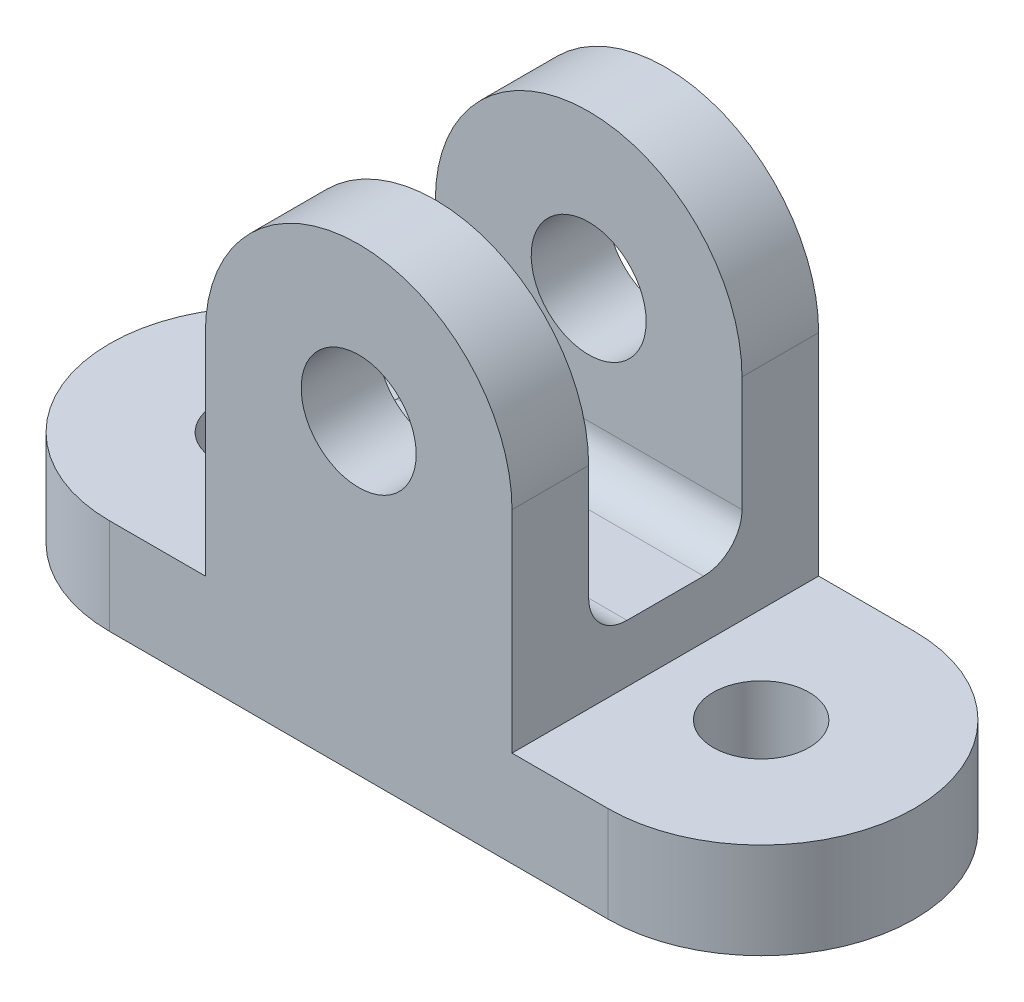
ISO-10303-21;
HEADER;
FILE_DESCRIPTION(('STEP AP214'),'2;1');
FILE_NAME('part.step','',(''),(''),'','','');
FILE_SCHEMA(('AUTOMOTIVE_DESIGN { 1 0 10303 214 1 1 1 1 }'));
ENDSEC;
DATA;
#1=APPLICATION_CONTEXT('core data for automotive mechanical design processes');
#2=APPLICATION_PROTOCOL_DEFINITION('international standard','automotive_design',2000,#1);
#3=PRODUCT_CONTEXT('',#1,'mechanical');
#4=PRODUCT('Part','Part','',(#3));
#5=PRODUCT_RELATED_PRODUCT_CATEGORY('part','',(#4));
#6=PRODUCT_DEFINITION_FORMATION('','',#4);
#7=PRODUCT_DEFINITION_CONTEXT('part definition',#1,'design');
#8=PRODUCT_DEFINITION('design','',#6,#7);
#9=PRODUCT_DEFINITION_SHAPE('','',#8);
#10=(LENGTH_UNIT() NAMED_UNIT(*) SI_UNIT(.MILLI.,.METRE.));
#11=(NAMED_UNIT(*) PLANE_ANGLE_UNIT() SI_UNIT($,.RADIAN.));
#12=(NAMED_UNIT(*) SI_UNIT($,.STERADIAN.) SOLID_ANGLE_UNIT());
#13=UNCERTAINTY_MEASURE_WITH_UNIT(LENGTH_MEASURE(1.E-05),#10,'distance_accuracy_value','');
#14=(GEOMETRIC_REPRESENTATION_CONTEXT(3) GLOBAL_UNCERTAINTY_ASSIGNED_CONTEXT((#13)) GLOBAL_UNIT_ASSIGNED_CONTEXT((#10,
#11,#12)) REPRESENTATION_CONTEXT('',''));
#15=CARTESIAN_POINT('',(0.,0.,0.));
#16=DIRECTION('',(0.,0.,1.));
#17=DIRECTION('',(1.,0.,0.));
#18=AXIS2_PLACEMENT_3D('',#15,#16,#17);
#19=CARTESIAN_POINT('',(0.,16.,-32.8394846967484));
#20=DIRECTION('',(0.,0.,1.));
#21=DIRECTION('',(1.,0.,0.));
#22=AXIS2_PLACEMENT_3D('',#19,#20,#21);
#23=CYLINDRICAL_SURFACE('',#22,8.);
#24=CARTESIAN_POINT('',(0.,16.,4.));
#25=DIRECTION('',(0.,0.,1.));
#26=DIRECTION('',(0.,-1.,0.));
#27=AXIS2_PLACEMENT_3D('',#24,#25,#26);
#28=CIRCLE('',#27,8.);
#29=CARTESIAN_POINT('',(-8.,16.,4.));
#30=VERTEX_POINT('',#29);
#31=CARTESIAN_POINT('',(8.,16.,4.));
#32=VERTEX_POINT('',#31);
#33=EDGE_CURVE('E313',#30,#32,#28,.F.);
#34=ORIENTED_EDGE('',*,*,#33,.F.);
#35=DIRECTION('',(0.,0.,1.));
#36=VECTOR('',#35,1.);
#37=CARTESIAN_POINT('',(-8.,16.,-32.8394846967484));
#38=LINE('',#37,#36);
#39=CARTESIAN_POINT('',(-8.,16.,8.));
#40=VERTEX_POINT('',#39);
#41=EDGE_CURVE('E161',#30,#40,#38,.T.);
#42=ORIENTED_EDGE('',*,*,#41,.T.);
#43=CARTESIAN_POINT('',(0.,16.,8.));
#44=DIRECTION('',(0.,0.,1.));
#45=DIRECTION('',(-1.,0.,0.));
#46=AXIS2_PLACEMENT_3D('',#43,#44,#45);
#47=CIRCLE('',#46,8.);
#48=CARTESIAN_POINT('',(8.,16.,8.));
#49=VERTEX_POINT('',#48);
#50=EDGE_CURVE('E324',#49,#40,#47,.T.);
#51=ORIENTED_EDGE('',*,*,#50,.F.);
#52=DIRECTION('',(0.,0.,1.));
#53=VECTOR('',#52,1.);
#54=CARTESIAN_POINT('',(8.,16.,-32.8394846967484));
#55=LINE('',#54,#53);
#56=EDGE_CURVE('E162',#32,#49,#55,.T.);
#57=ORIENTED_EDGE('',*,*,#56,.F.);
#58=EDGE_LOOP('',(#34,#42,#51,#57));
#59=FACE_BOUND('',#58,.T.);
#60=ADVANCED_FACE('F35',(#59),#23,.T.);
#61=CARTESIAN_POINT('',(-13.,5.,0.));
#62=DIRECTION('',(0.,1.,0.));
#63=DIRECTION('',(0.,0.,1.));
#64=AXIS2_PLACEMENT_3D('',#61,#62,#63);
#65=PLANE('',#64);
#66=CARTESIAN_POINT('',(13.,5.,0.));
#67=DIRECTION('',(0.,1.,0.));
#68=DIRECTION('',(0.,0.,1.));
#69=AXIS2_PLACEMENT_3D('',#66,#67,#68);
#70=CIRCLE('',#69,2.5);
#71=CARTESIAN_POINT('',(13.,5.,2.5));
#72=VERTEX_POINT('',#71);
#73=EDGE_CURVE('E296',#72,#72,#70,.T.);
#74=ORIENTED_EDGE('',*,*,#73,.F.);
#75=EDGE_LOOP('',(#74));
#76=FACE_BOUND('',#75,.T.);
#77=DIRECTION('',(-1.,0.,0.));
#78=VECTOR('',#77,1.);
#79=CARTESIAN_POINT('',(-13.,5.,-8.));
#80=LINE('',#79,#78);
#81=CARTESIAN_POINT('',(13.,5.,-8.00000000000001));
#82=VERTEX_POINT('',#81);
#83=CARTESIAN_POINT('',(8.,5.,-8.));
#84=VERTEX_POINT('',#83);
#85=EDGE_CURVE('E183',#82,#84,#80,.T.);
#86=ORIENTED_EDGE('',*,*,#85,.T.);
#87=DIRECTION('',(0.,0.,1.));
#88=VECTOR('',#87,1.);
#89=CARTESIAN_POINT('',(8.,5.,-32.8394846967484));
#90=LINE('',#89,#88);
#91=CARTESIAN_POINT('',(8.,5.,8.));
#92=VERTEX_POINT('',#91);
#93=EDGE_CURVE('E165',#84,#92,#90,.T.);
#94=ORIENTED_EDGE('',*,*,#93,.T.);
#95=DIRECTION('',(1.,0.,0.));
#96=VECTOR('',#95,1.);
#97=CARTESIAN_POINT('',(-13.,5.,8.));
#98=LINE('',#97,#96);
#99=CARTESIAN_POINT('',(13.,5.,7.99999999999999));
#100=VERTEX_POINT('',#99);
#101=EDGE_CURVE('E176',#92,#100,#98,.T.);
#102=ORIENTED_EDGE('',*,*,#101,.T.);
#103=CARTESIAN_POINT('',(13.,5.,0.));
#104=DIRECTION('',(0.,1.,0.));
#105=DIRECTION('',(0.,0.,1.));
#106=AXIS2_PLACEMENT_3D('',#103,#104,#105);
#107=CIRCLE('',#106,8.);
#108=EDGE_CURVE('E180',#100,#82,#107,.T.);
#109=ORIENTED_EDGE('',*,*,#108,.T.);
#110=EDGE_LOOP('',(#86,#94,#102,#109));
#111=FACE_BOUND('',#110,.T.);
#112=ADVANCED_FACE('F239',(#76,#111),#65,.T.);
#113=CARTESIAN_POINT('',(-13.,5.,0.));
#114=DIRECTION('',(0.,-1.,0.));
#115=DIRECTION('',(0.,0.,-1.));
#116=AXIS2_PLACEMENT_3D('',#113,#114,#115);
#117=CYLINDRICAL_SURFACE('',#116,8.);
#118=CARTESIAN_POINT('',(-13.,0.,0.));
#119=DIRECTION('',(0.,1.,0.));
#120=DIRECTION('',(0.,0.,1.));
#121=AXIS2_PLACEMENT_3D('',#118,#119,#120);
#122=CIRCLE('',#121,8.);
#123=CARTESIAN_POINT('',(-13.,0.,-8.));
#124=VERTEX_POINT('',#123);
#125=CARTESIAN_POINT('',(-13.,0.,8.));
#126=VERTEX_POINT('',#125);
#127=EDGE_CURVE('E171',#124,#126,#122,.T.);
#128=ORIENTED_EDGE('',*,*,#127,.T.);
#129=DIRECTION('',(0.,-1.,0.));
#130=VECTOR('',#129,1.);
#131=CARTESIAN_POINT('',(-13.,5.,8.));
#132=LINE('',#131,#130);
#133=CARTESIAN_POINT('',(-13.,5.,8.));
#134=VERTEX_POINT('',#133);
#135=EDGE_CURVE('E201',#134,#126,#132,.T.);
#136=ORIENTED_EDGE('',*,*,#135,.F.);
#137=CARTESIAN_POINT('',(-13.,5.,0.));
#138=DIRECTION('',(0.,1.,0.));
#139=DIRECTION('',(0.,0.,1.));
#140=AXIS2_PLACEMENT_3D('',#137,#138,#139);
#141=CIRCLE('',#140,8.);
#142=CARTESIAN_POINT('',(-13.,5.,-8.));
#143=VERTEX_POINT('',#142);
#144=EDGE_CURVE('E173',#143,#134,#141,.T.);
#145=ORIENTED_EDGE('',*,*,#144,.F.);
#146=DIRECTION('',(0.,-1.,0.));
#147=VECTOR('',#146,1.);
#148=CARTESIAN_POINT('',(-13.,5.,-8.));
#149=LINE('',#148,#147);
#150=EDGE_CURVE('E185',#143,#124,#149,.T.);
#151=ORIENTED_EDGE('',*,*,#150,.T.);
#152=EDGE_LOOP('',(#128,#136,#145,#151));
#153=FACE_BOUND('',#152,.T.);
#154=ADVANCED_FACE('F245',(#153),#117,.T.);
#155=CARTESIAN_POINT('',(-13.,5.,8.));
#156=DIRECTION('',(0.,0.,-1.));
#157=DIRECTION('',(-1.,0.,0.));
#158=AXIS2_PLACEMENT_3D('',#155,#156,#157);
#159=PLANE('',#158);
#160=CARTESIAN_POINT('',(0.,16.,8.));
#161=DIRECTION('',(0.,0.,1.));
#162=DIRECTION('',(1.,0.,0.));
#163=AXIS2_PLACEMENT_3D('',#160,#161,#162);
#164=CIRCLE('',#163,3.);
#165=CARTESIAN_POINT('',(3.,16.,8.));
#166=VERTEX_POINT('',#165);
#167=EDGE_CURVE('E293',#166,#166,#164,.T.);
#168=ORIENTED_EDGE('',*,*,#167,.F.);
#169=EDGE_LOOP('',(#168));
#170=FACE_BOUND('',#169,.T.);
#171=DIRECTION('',(1.,0.,0.));
#172=VECTOR('',#171,1.);
#173=CARTESIAN_POINT('',(-13.,0.,8.));
#174=LINE('',#173,#172);
#175=CARTESIAN_POINT('',(13.,0.,7.99999999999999));
#176=VERTEX_POINT('',#175);
#177=EDGE_CURVE('E188',#126,#176,#174,.T.);
#178=ORIENTED_EDGE('',*,*,#177,.T.);
#179=DIRECTION('',(0.,-1.,0.));
#180=VECTOR('',#179,1.);
#181=CARTESIAN_POINT('',(13.,5.,7.99999999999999));
#182=LINE('',#181,#180);
#183=EDGE_CURVE('E198',#100,#176,#182,.T.);
#184=ORIENTED_EDGE('',*,*,#183,.F.);
#185=ORIENTED_EDGE('',*,*,#101,.F.);
#186=DIRECTION('',(0.,1.,0.));
#187=VECTOR('',#186,1.);
#188=CARTESIAN_POINT('',(8.,16.,8.));
#189=LINE('',#188,#187);
#190=EDGE_CURVE('E317',#92,#49,#189,.T.);
#191=ORIENTED_EDGE('',*,*,#190,.T.);
#192=ORIENTED_EDGE('',*,*,#50,.T.);
#193=DIRECTION('',(0.,-1.,0.));
#194=VECTOR('',#193,1.);
#195=CARTESIAN_POINT('',(-8.,5.,8.));
#196=LINE('',#195,#194);
#197=CARTESIAN_POINT('',(-8.,5.,8.));
#198=VERTEX_POINT('',#197);
#199=EDGE_CURVE('E169',#40,#198,#196,.T.);
#200=ORIENTED_EDGE('',*,*,#199,.T.);
#201=EDGE_CURVE('E178',#134,#198,#98,.T.);
#202=ORIENTED_EDGE('',*,*,#201,.F.);
#203=ORIENTED_EDGE('',*,*,#135,.T.);
#204=EDGE_LOOP('',(#178,#184,#185,#191,#192,#200,#202,#203));
#205=FACE_BOUND('',#204,.T.);
#206=ADVANCED_FACE('F335',(#170,#205),#159,.F.);
#207=CARTESIAN_POINT('',(13.,5.,0.));
#208=DIRECTION('',(0.,-1.,0.));
#209=DIRECTION('',(0.,0.,-1.));
#210=AXIS2_PLACEMENT_3D('',#207,#208,#209);
#211=CYLINDRICAL_SURFACE('',#210,8.);
#212=CARTESIAN_POINT('',(13.,0.,0.));
#213=DIRECTION('',(0.,1.,0.));
#214=DIRECTION('',(0.,0.,1.));
#215=AXIS2_PLACEMENT_3D('',#212,#213,#214);
#216=CIRCLE('',#215,8.);
#217=CARTESIAN_POINT('',(13.,0.,-8.00000000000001));
#218=VERTEX_POINT('',#217);
#219=EDGE_CURVE('E190',#176,#218,#216,.T.);
#220=ORIENTED_EDGE('',*,*,#219,.T.);
#221=DIRECTION('',(0.,-1.,0.));
#222=VECTOR('',#221,1.);
#223=CARTESIAN_POINT('',(13.,5.,-8.00000000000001));
#224=LINE('',#223,#222);
#225=EDGE_CURVE('E195',#82,#218,#224,.T.);
#226=ORIENTED_EDGE('',*,*,#225,.F.);
#227=ORIENTED_EDGE('',*,*,#108,.F.);
#228=ORIENTED_EDGE('',*,*,#183,.T.);
#229=EDGE_LOOP('',(#220,#226,#227,#228));
#230=FACE_BOUND('',#229,.T.);
#231=ADVANCED_FACE('F350',(#230),#211,.T.);
#232=CARTESIAN_POINT('',(-13.,5.,-8.));
#233=DIRECTION('',(0.,0.,1.));
#234=DIRECTION('',(1.,0.,0.));
#235=AXIS2_PLACEMENT_3D('',#232,#233,#234);
#236=PLANE('',#235);
#237=CARTESIAN_POINT('',(0.,16.,-8.00000000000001));
#238=DIRECTION('',(0.,0.,1.));
#239=DIRECTION('',(1.,0.,0.));
#240=AXIS2_PLACEMENT_3D('',#237,#238,#239);
#241=CIRCLE('',#240,3.);
#242=CARTESIAN_POINT('',(3.,16.,-8.00000000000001));
#243=VERTEX_POINT('',#242);
#244=EDGE_CURVE('E212',#243,#243,#241,.T.);
#245=ORIENTED_EDGE('',*,*,#244,.T.);
#246=EDGE_LOOP('',(#245));
#247=FACE_BOUND('',#246,.T.);
#248=DIRECTION('',(-1.,0.,0.));
#249=VECTOR('',#248,1.);
#250=CARTESIAN_POINT('',(-13.,0.,-8.));
#251=LINE('',#250,#249);
#252=EDGE_CURVE('E177',#218,#124,#251,.T.);
#253=ORIENTED_EDGE('',*,*,#252,.T.);
#254=ORIENTED_EDGE('',*,*,#150,.F.);
#255=CARTESIAN_POINT('',(-8.,5.,-8.));
#256=VERTEX_POINT('',#255);
#257=EDGE_CURVE('E182',#256,#143,#80,.T.);
#258=ORIENTED_EDGE('',*,*,#257,.F.);
#259=DIRECTION('',(0.,1.,0.));
#260=VECTOR('',#259,1.);
#261=CARTESIAN_POINT('',(-8.,5.,-8.));
#262=LINE('',#261,#260);
#263=CARTESIAN_POINT('',(-8.,16.,-8.));
#264=VERTEX_POINT('',#263);
#265=EDGE_CURVE('E172',#256,#264,#262,.T.);
#266=ORIENTED_EDGE('',*,*,#265,.T.);
#267=CARTESIAN_POINT('',(0.,16.,-8.));
#268=DIRECTION('',(0.,0.,1.));
#269=DIRECTION('',(1.,0.,0.));
#270=AXIS2_PLACEMENT_3D('',#267,#268,#269);
#271=CIRCLE('',#270,8.);
#272=CARTESIAN_POINT('',(8.,16.,-8.));
#273=VERTEX_POINT('',#272);
#274=EDGE_CURVE('E318',#264,#273,#271,.F.);
#275=ORIENTED_EDGE('',*,*,#274,.T.);
#276=DIRECTION('',(0.,-1.,0.));
#277=VECTOR('',#276,1.);
#278=CARTESIAN_POINT('',(8.,16.,-8.));
#279=LINE('',#278,#277);
#280=EDGE_CURVE('E160',#273,#84,#279,.T.);
#281=ORIENTED_EDGE('',*,*,#280,.T.);
#282=ORIENTED_EDGE('',*,*,#85,.F.);
#283=ORIENTED_EDGE('',*,*,#225,.T.);
#284=EDGE_LOOP('',(#253,#254,#258,#266,#275,#281,#282,#283));
#285=FACE_BOUND('',#284,.T.);
#286=ADVANCED_FACE('F353',(#247,#285),#236,.F.);
#287=CARTESIAN_POINT('',(-13.,5.,0.));
#288=DIRECTION('',(0.,1.,0.));
#289=DIRECTION('',(0.,0.,1.));
#290=AXIS2_PLACEMENT_3D('',#287,#288,#289);
#291=CIRCLE('',#290,2.5);
#292=CARTESIAN_POINT('',(-13.,5.,2.5));
#293=VERTEX_POINT('',#292);
#294=EDGE_CURVE('E306',#293,#293,#291,.T.);
#295=ORIENTED_EDGE('',*,*,#294,.F.);
#296=EDGE_LOOP('',(#295));
#297=FACE_BOUND('',#296,.T.);
#298=DIRECTION('',(0.,0.,1.));
#299=VECTOR('',#298,1.);
#300=CARTESIAN_POINT('',(-8.,5.,-32.8394846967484));
#301=LINE('',#300,#299);
#302=EDGE_CURVE('E320',#256,#198,#301,.T.);
#303=ORIENTED_EDGE('',*,*,#302,.F.);
#304=ORIENTED_EDGE('',*,*,#257,.T.);
#305=ORIENTED_EDGE('',*,*,#144,.T.);
#306=ORIENTED_EDGE('',*,*,#201,.T.);
#307=EDGE_LOOP('',(#303,#304,#305,#306));
#308=FACE_BOUND('',#307,.T.);
#309=ADVANCED_FACE('F248',(#297,#308),#65,.T.);
#310=CARTESIAN_POINT('',(-13.,0.,0.));
#311=DIRECTION('',(0.,1.,0.));
#312=DIRECTION('',(0.,0.,1.));
#313=AXIS2_PLACEMENT_3D('',#310,#311,#312);
#314=PLANE('',#313);
#315=CARTESIAN_POINT('',(-13.,0.,0.));
#316=DIRECTION('',(0.,1.,0.));
#317=DIRECTION('',(0.,0.,1.));
#318=AXIS2_PLACEMENT_3D('',#315,#316,#317);
#319=CIRCLE('',#318,2.5);
#320=CARTESIAN_POINT('',(-13.,0.,2.5));
#321=VERTEX_POINT('',#320);
#322=EDGE_CURVE('E229',#321,#321,#319,.T.);
#323=ORIENTED_EDGE('',*,*,#322,.T.);
#324=EDGE_LOOP('',(#323));
#325=FACE_BOUND('',#324,.T.);
#326=CARTESIAN_POINT('',(13.,0.,0.));
#327=DIRECTION('',(0.,1.,0.));
#328=DIRECTION('',(0.,0.,1.));
#329=AXIS2_PLACEMENT_3D('',#326,#327,#328);
#330=CIRCLE('',#329,2.5);
#331=CARTESIAN_POINT('',(13.,0.,2.5));
#332=VERTEX_POINT('',#331);
#333=EDGE_CURVE('E299',#332,#332,#330,.T.);
#334=ORIENTED_EDGE('',*,*,#333,.T.);
#335=EDGE_LOOP('',(#334));
#336=FACE_BOUND('',#335,.T.);
#337=ORIENTED_EDGE('',*,*,#127,.F.);
#338=ORIENTED_EDGE('',*,*,#252,.F.);
#339=ORIENTED_EDGE('',*,*,#219,.F.);
#340=ORIENTED_EDGE('',*,*,#177,.F.);
#341=EDGE_LOOP('',(#337,#338,#339,#340));
#342=FACE_BOUND('',#341,.T.);
#343=ADVANCED_FACE('F259',(#325,#336,#342),#314,.F.);
#344=CARTESIAN_POINT('',(-8.,5.,-32.8394846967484));
#345=DIRECTION('',(-1.,0.,0.));
#346=DIRECTION('',(0.,0.,1.));
#347=AXIS2_PLACEMENT_3D('',#344,#345,#346);
#348=PLANE('',#347);
#349=DIRECTION('',(0.,1.,0.));
#350=VECTOR('',#349,1.);
#351=CARTESIAN_POINT('',(-8.,5.,4.));
#352=LINE('',#351,#350);
#353=CARTESIAN_POINT('',(-8.,10.,4.));
#354=VERTEX_POINT('',#353);
#355=EDGE_CURVE('E315',#354,#30,#352,.T.);
#356=ORIENTED_EDGE('',*,*,#355,.F.);
#357=CARTESIAN_POINT('',(-8.,10.,1.99999999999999));
#358=DIRECTION('',(-1.,0.,0.));
#359=DIRECTION('',(0.,0.,1.));
#360=AXIS2_PLACEMENT_3D('',#357,#358,#359);
#361=CIRCLE('',#360,2.);
#362=CARTESIAN_POINT('',(-8.,8.,1.99999999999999));
#363=VERTEX_POINT('',#362);
#364=EDGE_CURVE('E222',#354,#363,#361,.F.);
#365=ORIENTED_EDGE('',*,*,#364,.T.);
#366=DIRECTION('',(0.,0.,1.));
#367=VECTOR('',#366,1.);
#368=CARTESIAN_POINT('',(-8.,8.00000000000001,-32.8394846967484));
#369=LINE('',#368,#367);
#370=CARTESIAN_POINT('',(-8.,8.,-1.99999999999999));
#371=VERTEX_POINT('',#370);
#372=EDGE_CURVE('E142',#371,#363,#369,.T.);
#373=ORIENTED_EDGE('',*,*,#372,.F.);
#374=CARTESIAN_POINT('',(-8.,10.,-1.99999999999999));
#375=DIRECTION('',(-1.,0.,0.));
#376=DIRECTION('',(0.,0.,1.));
#377=AXIS2_PLACEMENT_3D('',#374,#375,#376);
#378=CIRCLE('',#377,2.);
#379=CARTESIAN_POINT('',(-8.,10.,-4.));
#380=VERTEX_POINT('',#379);
#381=EDGE_CURVE('E11',#371,#380,#378,.F.);
#382=ORIENTED_EDGE('',*,*,#381,.T.);
#383=DIRECTION('',(0.,-1.,0.));
#384=VECTOR('',#383,1.);
#385=CARTESIAN_POINT('',(-8.,5.,-4.));
#386=LINE('',#385,#384);
#387=CARTESIAN_POINT('',(-8.,16.,-3.99999999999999));
#388=VERTEX_POINT('',#387);
#389=EDGE_CURVE('E154',#388,#380,#386,.T.);
#390=ORIENTED_EDGE('',*,*,#389,.F.);
#391=EDGE_CURVE('E153',#264,#388,#38,.T.);
#392=ORIENTED_EDGE('',*,*,#391,.F.);
#393=ORIENTED_EDGE('',*,*,#265,.F.);
#394=ORIENTED_EDGE('',*,*,#302,.T.);
#395=ORIENTED_EDGE('',*,*,#199,.F.);
#396=ORIENTED_EDGE('',*,*,#41,.F.);
#397=EDGE_LOOP('',(#356,#365,#373,#382,#390,#392,#393,#394,#395,#396));
#398=FACE_BOUND('',#397,.T.);
#399=ADVANCED_FACE('F253',(#398),#348,.T.);
#400=CARTESIAN_POINT('',(0.,16.,-3.99999999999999));
#401=DIRECTION('',(0.,0.,-1.));
#402=DIRECTION('',(0.,1.,0.));
#403=AXIS2_PLACEMENT_3D('',#400,#401,#402);
#404=CIRCLE('',#403,8.);
#405=CARTESIAN_POINT('',(8.,16.,-3.99999999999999));
#406=VERTEX_POINT('',#405);
#407=EDGE_CURVE('E138',#406,#388,#404,.F.);
#408=ORIENTED_EDGE('',*,*,#407,.F.);
#409=EDGE_CURVE('E150',#273,#406,#55,.T.);
#410=ORIENTED_EDGE('',*,*,#409,.F.);
#411=ORIENTED_EDGE('',*,*,#274,.F.);
#412=ORIENTED_EDGE('',*,*,#391,.T.);
#413=EDGE_LOOP('',(#408,#410,#411,#412));
#414=FACE_BOUND('',#413,.T.);
#415=ADVANCED_FACE('F148',(#414),#23,.T.);
#416=CARTESIAN_POINT('',(8.,16.,-32.8394846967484));
#417=DIRECTION('',(1.,0.,0.));
#418=DIRECTION('',(0.,1.,0.));
#419=AXIS2_PLACEMENT_3D('',#416,#417,#418);
#420=PLANE('',#419);
#421=DIRECTION('',(0.,-1.,0.));
#422=VECTOR('',#421,1.);
#423=CARTESIAN_POINT('',(8.,16.,4.));
#424=LINE('',#423,#422);
#425=CARTESIAN_POINT('',(8.,10.,4.));
#426=VERTEX_POINT('',#425);
#427=EDGE_CURVE('E204',#32,#426,#424,.T.);
#428=ORIENTED_EDGE('',*,*,#427,.F.);
#429=ORIENTED_EDGE('',*,*,#56,.T.);
#430=ORIENTED_EDGE('',*,*,#190,.F.);
#431=ORIENTED_EDGE('',*,*,#93,.F.);
#432=ORIENTED_EDGE('',*,*,#280,.F.);
#433=ORIENTED_EDGE('',*,*,#409,.T.);
#434=DIRECTION('',(0.,1.,0.));
#435=VECTOR('',#434,1.);
#436=CARTESIAN_POINT('',(8.00000000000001,24.,-3.99999999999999));
#437=LINE('',#436,#435);
#438=CARTESIAN_POINT('',(8.,10.,-3.99999999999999));
#439=VERTEX_POINT('',#438);
#440=EDGE_CURVE('E135',#439,#406,#437,.T.);
#441=ORIENTED_EDGE('',*,*,#440,.F.);
#442=CARTESIAN_POINT('',(8.,10.,-1.99999999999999));
#443=DIRECTION('',(1.,0.,0.));
#444=DIRECTION('',(0.,1.,0.));
#445=AXIS2_PLACEMENT_3D('',#442,#443,#444);
#446=CIRCLE('',#445,2.);
#447=CARTESIAN_POINT('',(8.,8.,-1.99999999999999));
#448=VERTEX_POINT('',#447);
#449=EDGE_CURVE('E43',#439,#448,#446,.F.);
#450=ORIENTED_EDGE('',*,*,#449,.T.);
#451=DIRECTION('',(0.,0.,-1.));
#452=VECTOR('',#451,1.);
#453=CARTESIAN_POINT('',(8.,8.,3.99999999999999));
#454=LINE('',#453,#452);
#455=CARTESIAN_POINT('',(8.,8.,1.99999999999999));
#456=VERTEX_POINT('',#455);
#457=EDGE_CURVE('E143',#456,#448,#454,.T.);
#458=ORIENTED_EDGE('',*,*,#457,.F.);
#459=CARTESIAN_POINT('',(8.,10.,1.99999999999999));
#460=DIRECTION('',(1.,0.,0.));
#461=DIRECTION('',(0.,1.,0.));
#462=AXIS2_PLACEMENT_3D('',#459,#460,#461);
#463=CIRCLE('',#462,2.);
#464=EDGE_CURVE('E220',#456,#426,#463,.F.);
#465=ORIENTED_EDGE('',*,*,#464,.T.);
#466=EDGE_LOOP('',(#428,#429,#430,#431,#432,#433,#441,#450,#458,#465));
#467=FACE_BOUND('',#466,.T.);
#468=ADVANCED_FACE('F157',(#467),#420,.T.);
#469=CARTESIAN_POINT('',(-21.,24.,4.));
#470=DIRECTION('',(0.,0.,1.));
#471=DIRECTION('',(0.,-1.,0.));
#472=AXIS2_PLACEMENT_3D('',#469,#470,#471);
#473=PLANE('',#472);
#474=CARTESIAN_POINT('',(0.,16.,4.));
#475=DIRECTION('',(0.,0.,1.));
#476=DIRECTION('',(0.,-1.,0.));
#477=AXIS2_PLACEMENT_3D('',#474,#475,#476);
#478=CIRCLE('',#477,3.);
#479=CARTESIAN_POINT('',(0.,13.,4.));
#480=VERTEX_POINT('',#479);
#481=EDGE_CURVE('E211',#480,#480,#478,.T.);
#482=ORIENTED_EDGE('',*,*,#481,.T.);
#483=EDGE_LOOP('',(#482));
#484=FACE_BOUND('',#483,.T.);
#485=ORIENTED_EDGE('',*,*,#427,.T.);
#486=DIRECTION('',(1.,0.,0.));
#487=VECTOR('',#486,1.);
#488=CARTESIAN_POINT('',(-8.,10.,3.99999999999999));
#489=LINE('',#488,#487);
#490=EDGE_CURVE('E217',#426,#354,#489,.F.);
#491=ORIENTED_EDGE('',*,*,#490,.T.);
#492=ORIENTED_EDGE('',*,*,#355,.T.);
#493=ORIENTED_EDGE('',*,*,#33,.T.);
#494=EDGE_LOOP('',(#485,#491,#492,#493));
#495=FACE_BOUND('',#494,.T.);
#496=ADVANCED_FACE('F258',(#484,#495),#473,.F.);
#497=CARTESIAN_POINT('',(-21.,24.,-3.99999999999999));
#498=DIRECTION('',(0.,0.,-1.));
#499=DIRECTION('',(0.,1.,0.));
#500=AXIS2_PLACEMENT_3D('',#497,#498,#499);
#501=PLANE('',#500);
#502=CARTESIAN_POINT('',(0.,16.,-3.99999999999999));
#503=DIRECTION('',(0.,0.,-1.));
#504=DIRECTION('',(0.,1.,0.));
#505=AXIS2_PLACEMENT_3D('',#502,#503,#504);
#506=CIRCLE('',#505,3.);
#507=CARTESIAN_POINT('',(0.,19.,-3.99999999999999));
#508=VERTEX_POINT('',#507);
#509=EDGE_CURVE('E208',#508,#508,#506,.T.);
#510=ORIENTED_EDGE('',*,*,#509,.T.);
#511=EDGE_LOOP('',(#510));
#512=FACE_BOUND('',#511,.T.);
#513=ORIENTED_EDGE('',*,*,#389,.T.);
#514=DIRECTION('',(1.,0.,0.));
#515=VECTOR('',#514,1.);
#516=CARTESIAN_POINT('',(8.,10.,-3.99999999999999));
#517=LINE('',#516,#515);
#518=EDGE_CURVE('E139',#380,#439,#517,.T.);
#519=ORIENTED_EDGE('',*,*,#518,.T.);
#520=ORIENTED_EDGE('',*,*,#440,.T.);
#521=ORIENTED_EDGE('',*,*,#407,.T.);
#522=EDGE_LOOP('',(#513,#519,#520,#521));
#523=FACE_BOUND('',#522,.T.);
#524=ADVANCED_FACE('F137',(#512,#523),#501,.F.);
#525=CARTESIAN_POINT('',(-21.,8.,3.99999999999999));
#526=DIRECTION('',(0.,-1.,0.));
#527=DIRECTION('',(0.,0.,-1.));
#528=AXIS2_PLACEMENT_3D('',#525,#526,#527);
#529=PLANE('',#528);
#530=ORIENTED_EDGE('',*,*,#372,.T.);
#531=DIRECTION('',(1.,0.,0.));
#532=VECTOR('',#531,1.);
#533=CARTESIAN_POINT('',(8.,8.,1.99999999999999));
#534=LINE('',#533,#532);
#535=EDGE_CURVE('E214',#363,#456,#534,.T.);
#536=ORIENTED_EDGE('',*,*,#535,.T.);
#537=ORIENTED_EDGE('',*,*,#457,.T.);
#538=DIRECTION('',(1.,0.,0.));
#539=VECTOR('',#538,1.);
#540=CARTESIAN_POINT('',(-8.,8.,-2.));
#541=LINE('',#540,#539);
#542=EDGE_CURVE('E207',#448,#371,#541,.F.);
#543=ORIENTED_EDGE('',*,*,#542,.T.);
#544=EDGE_LOOP('',(#530,#536,#537,#543));
#545=FACE_BOUND('',#544,.T.);
#546=ADVANCED_FACE('F227',(#545),#529,.F.);
#547=CARTESIAN_POINT('',(13.,0.,0.));
#548=DIRECTION('',(0.,1.,0.));
#549=DIRECTION('',(0.,0.,1.));
#550=AXIS2_PLACEMENT_3D('',#547,#548,#549);
#551=CYLINDRICAL_SURFACE('',#550,2.5);
#552=ORIENTED_EDGE('',*,*,#333,.F.);
#553=EDGE_LOOP('',(#552));
#554=FACE_BOUND('',#553,.T.);
#555=ORIENTED_EDGE('',*,*,#73,.T.);
#556=EDGE_LOOP('',(#555));
#557=FACE_BOUND('',#556,.T.);
#558=ADVANCED_FACE('F272',(#554,#557),#551,.F.);
#559=CARTESIAN_POINT('',(-13.,0.,0.));
#560=DIRECTION('',(0.,1.,0.));
#561=DIRECTION('',(0.,0.,1.));
#562=AXIS2_PLACEMENT_3D('',#559,#560,#561);
#563=CYLINDRICAL_SURFACE('',#562,2.5);
#564=ORIENTED_EDGE('',*,*,#322,.F.);
#565=EDGE_LOOP('',(#564));
#566=FACE_BOUND('',#565,.T.);
#567=ORIENTED_EDGE('',*,*,#294,.T.);
#568=EDGE_LOOP('',(#567));
#569=FACE_BOUND('',#568,.T.);
#570=ADVANCED_FACE('F278',(#566,#569),#563,.F.);
#571=CARTESIAN_POINT('',(0.,16.,-8.00000000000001));
#572=DIRECTION('',(0.,0.,1.));
#573=DIRECTION('',(1.,0.,0.));
#574=AXIS2_PLACEMENT_3D('',#571,#572,#573);
#575=CYLINDRICAL_SURFACE('',#574,3.);
#576=ORIENTED_EDGE('',*,*,#244,.F.);
#577=EDGE_LOOP('',(#576));
#578=FACE_BOUND('',#577,.T.);
#579=ORIENTED_EDGE('',*,*,#509,.F.);
#580=EDGE_LOOP('',(#579));
#581=FACE_BOUND('',#580,.T.);
#582=ADVANCED_FACE('F282',(#578,#581),#575,.F.);
#583=ORIENTED_EDGE('',*,*,#167,.T.);
#584=EDGE_LOOP('',(#583));
#585=FACE_BOUND('',#584,.T.);
#586=ORIENTED_EDGE('',*,*,#481,.F.);
#587=EDGE_LOOP('',(#586));
#588=FACE_BOUND('',#587,.T.);
#589=ADVANCED_FACE('F236',(#585,#588),#575,.F.);
#590=CARTESIAN_POINT('',(-21.,10.,1.99999999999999));
#591=DIRECTION('',(-1.,0.,0.));
#592=DIRECTION('',(0.,-1.,0.));
#593=AXIS2_PLACEMENT_3D('',#590,#591,#592);
#594=CYLINDRICAL_SURFACE('',#593,2.);
#595=ORIENTED_EDGE('',*,*,#364,.F.);
#596=ORIENTED_EDGE('',*,*,#490,.F.);
#597=ORIENTED_EDGE('',*,*,#464,.F.);
#598=ORIENTED_EDGE('',*,*,#535,.F.);
#599=EDGE_LOOP('',(#595,#596,#597,#598));
#600=FACE_BOUND('',#599,.T.);
#601=ADVANCED_FACE('F232',(#600),#594,.F.);
#602=CARTESIAN_POINT('',(-21.,10.,-1.99999999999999));
#603=DIRECTION('',(-1.,0.,0.));
#604=DIRECTION('',(0.,-1.,0.));
#605=AXIS2_PLACEMENT_3D('',#602,#603,#604);
#606=CYLINDRICAL_SURFACE('',#605,2.);
#607=ORIENTED_EDGE('',*,*,#381,.F.);
#608=ORIENTED_EDGE('',*,*,#542,.F.);
#609=ORIENTED_EDGE('',*,*,#449,.F.);
#610=ORIENTED_EDGE('',*,*,#518,.F.);
#611=EDGE_LOOP('',(#607,#608,#609,#610));
#612=FACE_BOUND('',#611,.T.);
#613=ADVANCED_FACE('F37',(#612),#606,.F.);
#614=CLOSED_SHELL('',(#60,#112,#154,#206,#231,#286,#309,#343,#399,#415,#468,#496,#524,#546,#558,
#570,#582,#589,#601,#613));
#615=MANIFOLD_SOLID_BREP('B2',#614);
#616=ADVANCED_BREP_SHAPE_REPRESENTATION('',(#18,#615),#14);
#617=SHAPE_DEFINITION_REPRESENTATION(#9,#616);
ENDSEC;
END-ISO-10303-21;
